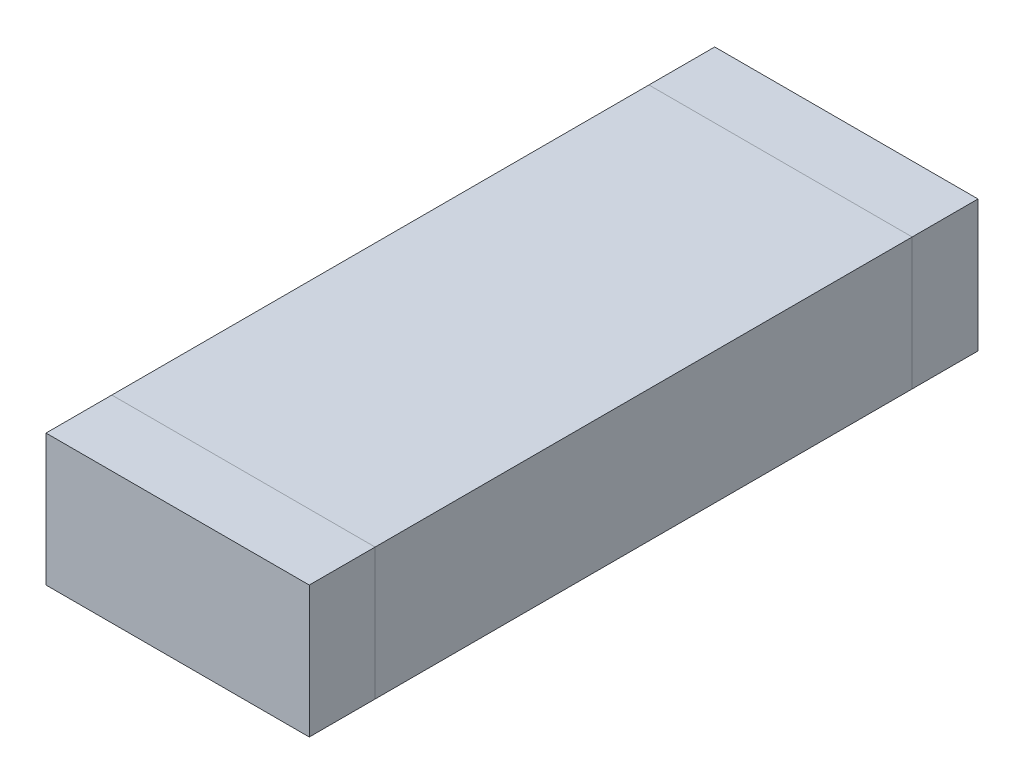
from build123d import *

# Parameters (mm, degrees)
SKETCH1_W      = 1
SKETCH1_H      = 2.54
EXTRUDE1_DEPTH = 0.5


with BuildPart() as part:
    # Sketch1 → Extrude1 (new body)
    with BuildSketch(Plane(origin=(0, 0, 0), x_dir=(1, 0, 0), z_dir=(0, 1, 0))):
        Rectangle(SKETCH1_W, SKETCH1_H)
    extrude(amount=EXTRUDE1_DEPTH)


solid = part.part
